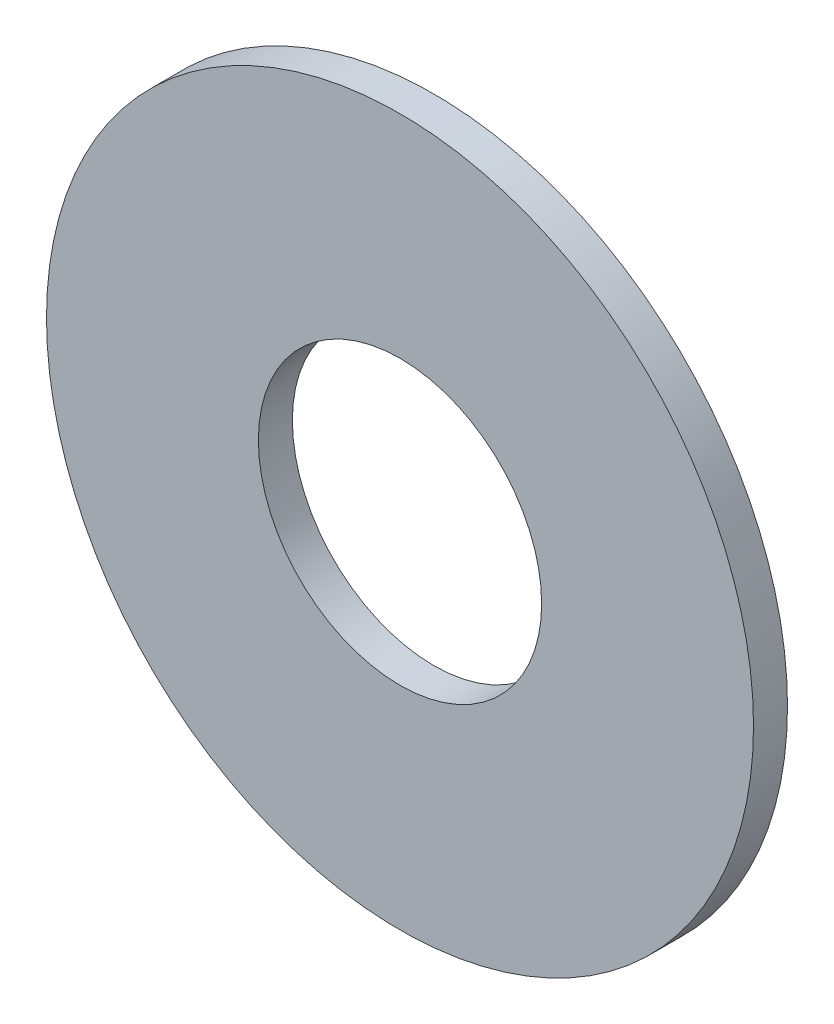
ISO-10303-21;
HEADER;
FILE_DESCRIPTION(('STEP AP214'),'2;1');
FILE_NAME('part.step','',(''),(''),'','','');
FILE_SCHEMA(('AUTOMOTIVE_DESIGN { 1 0 10303 214 1 1 1 1 }'));
ENDSEC;
DATA;
#1=APPLICATION_CONTEXT('core data for automotive mechanical design processes');
#2=APPLICATION_PROTOCOL_DEFINITION('international standard','automotive_design',2000,#1);
#3=PRODUCT_CONTEXT('',#1,'mechanical');
#4=PRODUCT('Part','Part','',(#3));
#5=PRODUCT_RELATED_PRODUCT_CATEGORY('part','',(#4));
#6=PRODUCT_DEFINITION_FORMATION('','',#4);
#7=PRODUCT_DEFINITION_CONTEXT('part definition',#1,'design');
#8=PRODUCT_DEFINITION('design','',#6,#7);
#9=PRODUCT_DEFINITION_SHAPE('','',#8);
#10=(LENGTH_UNIT() NAMED_UNIT(*) SI_UNIT(.MILLI.,.METRE.));
#11=(NAMED_UNIT(*) PLANE_ANGLE_UNIT() SI_UNIT($,.RADIAN.));
#12=(NAMED_UNIT(*) SI_UNIT($,.STERADIAN.) SOLID_ANGLE_UNIT());
#13=UNCERTAINTY_MEASURE_WITH_UNIT(LENGTH_MEASURE(1.E-05),#10,'distance_accuracy_value','');
#14=(GEOMETRIC_REPRESENTATION_CONTEXT(3) GLOBAL_UNCERTAINTY_ASSIGNED_CONTEXT((#13)) GLOBAL_UNIT_ASSIGNED_CONTEXT((#10,
#11,#12)) REPRESENTATION_CONTEXT('',''));
#15=CARTESIAN_POINT('',(0.,0.,0.));
#16=DIRECTION('',(0.,0.,1.));
#17=DIRECTION('',(1.,0.,0.));
#18=AXIS2_PLACEMENT_3D('',#15,#16,#17);
#19=CARTESIAN_POINT('',(0.,0.,0.381));
#20=DIRECTION('',(0.,0.,1.));
#21=DIRECTION('',(1.,0.,0.));
#22=AXIS2_PLACEMENT_3D('',#19,#20,#21);
#23=PLANE('',#22);
#24=CARTESIAN_POINT('',(0.,0.,0.381));
#25=DIRECTION('',(0.,0.,1.));
#26=DIRECTION('',(1.,0.,0.));
#27=AXIS2_PLACEMENT_3D('',#24,#25,#26);
#28=CIRCLE('',#27,1.5875);
#29=CARTESIAN_POINT('',(1.5875,0.,0.381));
#30=VERTEX_POINT('',#29);
#31=EDGE_CURVE('E26',#30,#30,#28,.F.);
#32=ORIENTED_EDGE('',*,*,#31,.T.);
#33=EDGE_LOOP('',(#32));
#34=FACE_BOUND('',#33,.T.);
#35=CARTESIAN_POINT('',(0.,0.,0.381));
#36=DIRECTION('',(0.,0.,1.));
#37=DIRECTION('',(1.,0.,0.));
#38=AXIS2_PLACEMENT_3D('',#35,#36,#37);
#39=CIRCLE('',#38,3.9624);
#40=CARTESIAN_POINT('',(3.9624,0.,0.381));
#41=VERTEX_POINT('',#40);
#42=EDGE_CURVE('E17',#41,#41,#39,.F.);
#43=ORIENTED_EDGE('',*,*,#42,.F.);
#44=EDGE_LOOP('',(#43));
#45=FACE_BOUND('',#44,.T.);
#46=ADVANCED_FACE('F14',(#34,#45),#23,.T.);
#47=CARTESIAN_POINT('',(0.,0.,0.));
#48=DIRECTION('',(0.,0.,1.));
#49=DIRECTION('',(1.,0.,0.));
#50=AXIS2_PLACEMENT_3D('',#47,#48,#49);
#51=CYLINDRICAL_SURFACE('',#50,3.9624);
#52=ORIENTED_EDGE('',*,*,#42,.T.);
#53=EDGE_LOOP('',(#52));
#54=FACE_BOUND('',#53,.T.);
#55=CARTESIAN_POINT('',(0.,0.,0.));
#56=DIRECTION('',(0.,0.,1.));
#57=DIRECTION('',(1.,0.,0.));
#58=AXIS2_PLACEMENT_3D('',#55,#56,#57);
#59=CIRCLE('',#58,3.9624);
#60=CARTESIAN_POINT('',(3.9624,0.,0.));
#61=VERTEX_POINT('',#60);
#62=EDGE_CURVE('E21',#61,#61,#59,.T.);
#63=ORIENTED_EDGE('',*,*,#62,.T.);
#64=EDGE_LOOP('',(#63));
#65=FACE_BOUND('',#64,.T.);
#66=ADVANCED_FACE('F34',(#54,#65),#51,.T.);
#67=CARTESIAN_POINT('',(0.,0.,0.));
#68=DIRECTION('',(0.,0.,1.));
#69=DIRECTION('',(1.,0.,0.));
#70=AXIS2_PLACEMENT_3D('',#67,#68,#69);
#71=CYLINDRICAL_SURFACE('',#70,1.5875);
#72=ORIENTED_EDGE('',*,*,#31,.F.);
#73=EDGE_LOOP('',(#72));
#74=FACE_BOUND('',#73,.T.);
#75=CARTESIAN_POINT('',(0.,0.,0.));
#76=DIRECTION('',(0.,0.,1.));
#77=DIRECTION('',(1.,0.,0.));
#78=AXIS2_PLACEMENT_3D('',#75,#76,#77);
#79=CIRCLE('',#78,1.5875);
#80=CARTESIAN_POINT('',(1.5875,0.,0.));
#81=VERTEX_POINT('',#80);
#82=EDGE_CURVE('E10',#81,#81,#79,.F.);
#83=ORIENTED_EDGE('',*,*,#82,.T.);
#84=EDGE_LOOP('',(#83));
#85=FACE_BOUND('',#84,.T.);
#86=ADVANCED_FACE('F42',(#74,#85),#71,.F.);
#87=CARTESIAN_POINT('',(0.,0.,0.));
#88=DIRECTION('',(0.,0.,1.));
#89=DIRECTION('',(1.,0.,0.));
#90=AXIS2_PLACEMENT_3D('',#87,#88,#89);
#91=PLANE('',#90);
#92=ORIENTED_EDGE('',*,*,#82,.F.);
#93=EDGE_LOOP('',(#92));
#94=FACE_BOUND('',#93,.T.);
#95=ORIENTED_EDGE('',*,*,#62,.F.);
#96=EDGE_LOOP('',(#95));
#97=FACE_BOUND('',#96,.T.);
#98=ADVANCED_FACE('F43',(#94,#97),#91,.F.);
#99=CLOSED_SHELL('',(#46,#66,#86,#98));
#100=MANIFOLD_SOLID_BREP('B1',#99);
#101=ADVANCED_BREP_SHAPE_REPRESENTATION('',(#18,#100),#14);
#102=SHAPE_DEFINITION_REPRESENTATION(#9,#101);
ENDSEC;
END-ISO-10303-21;
